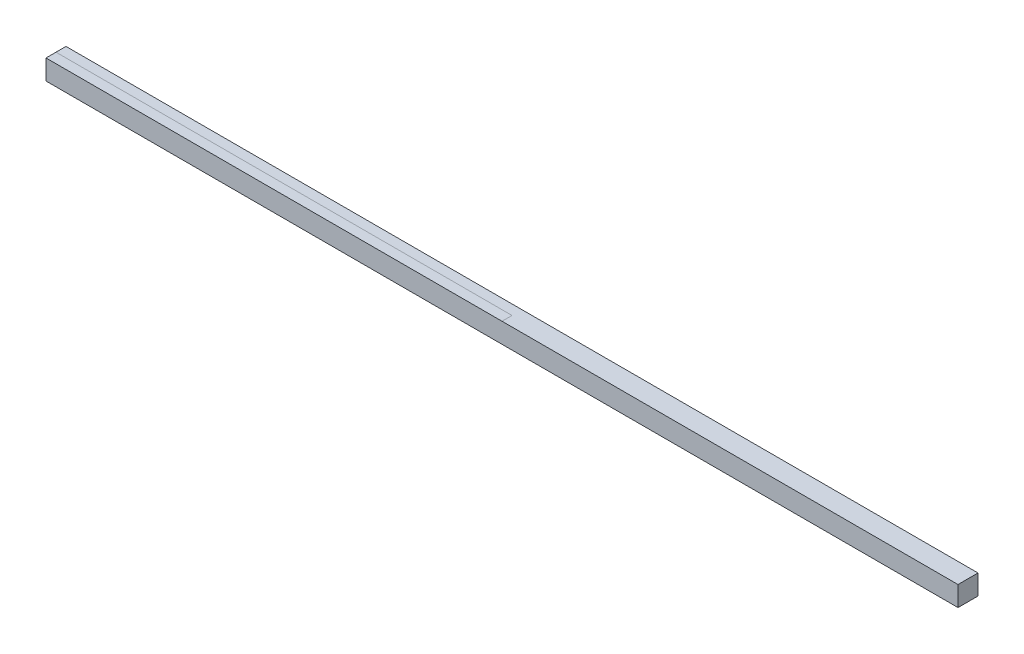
from build123d import *

# Parameters (mm, degrees)
SKETCH1_W      = 1158.730000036
SKETCH1_H      = 25.4
EXTRUDE1_DEPTH = 12.7


with BuildPart() as part:
    # Sketch1 → Extrude1 (new, symmetric)
    with BuildSketch(Plane.XY):
        with Locations((0, 12.7)):
            Rectangle(SKETCH1_W, SKETCH1_H)
    extrude(amount=EXTRUDE1_DEPTH, both=True)


solid = part.part
